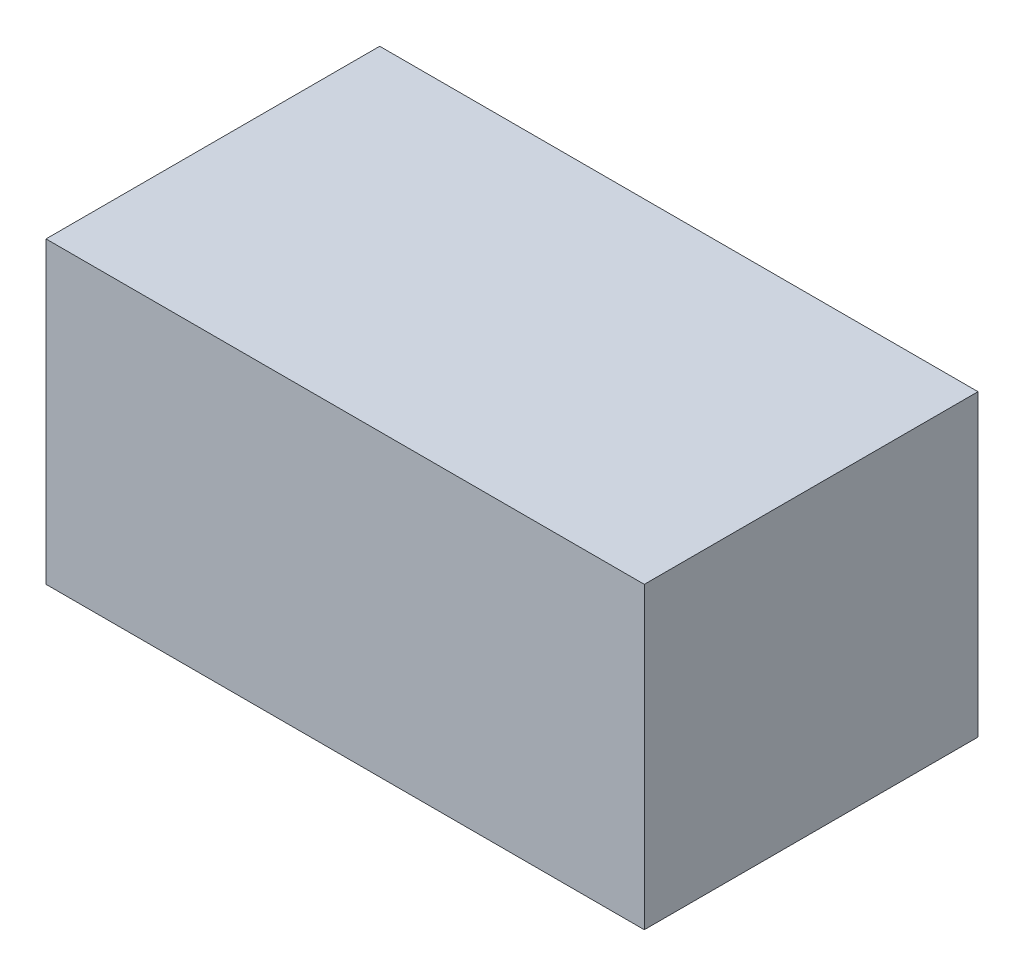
from build123d import *

# Parameters (mm, degrees)
GENERAL_W           = 1.524
GENERAL_H           = 0.762
BOSS_EXTRUDE1_DEPTH = 0.849999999


with BuildPart() as part:
    # GENERAL → Boss-Extrude1 (new body)
    with BuildSketch(Plane.XY):
        Rectangle(GENERAL_W, GENERAL_H)
    extrude(amount=BOSS_EXTRUDE1_DEPTH)


solid = part.part
